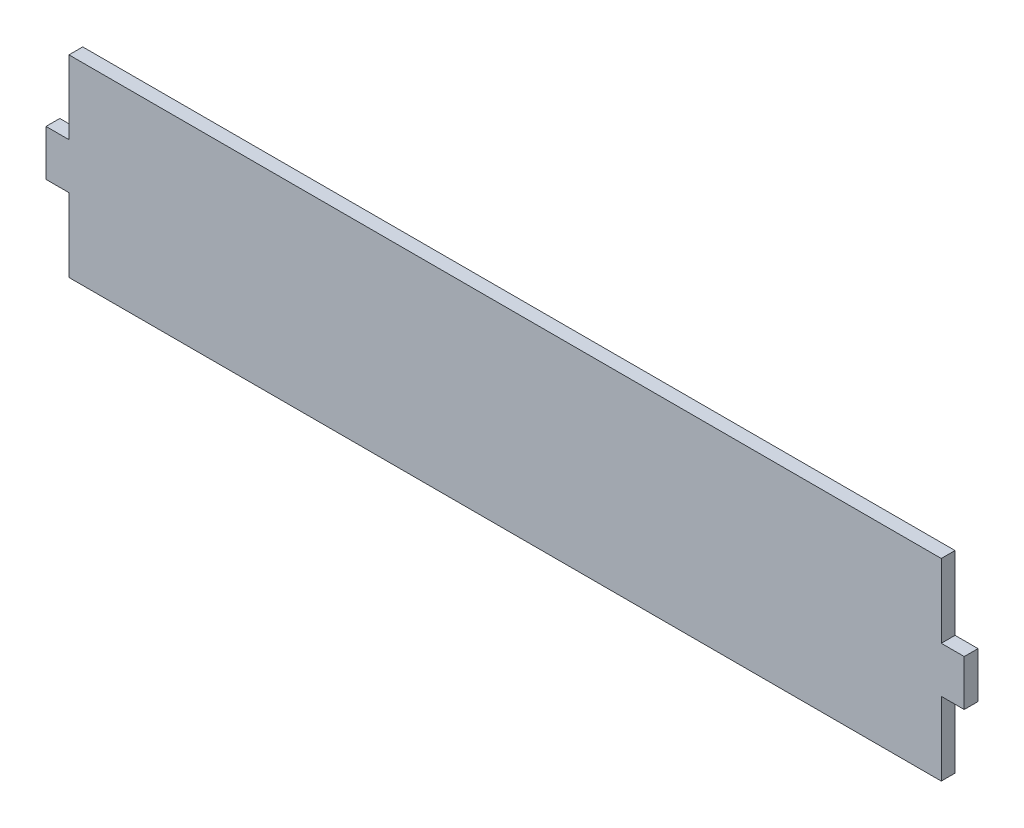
from build123d import *

# Parameters (mm, degrees)
EXTRUDE1_DEPTH = 3.81


with BuildPart() as part:
    # Sketch1 → Extrude1 (new body)
    with BuildSketch(Plane.XY):
        Polygon((-107.058637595, 12.7), (-107.058637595, 33.02), (134.241362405, 33.02), (134.241362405, 12.7), (140.591362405, 12.7), (140.591362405, 0), (134.241362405, 0), (134.241362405, -20.32), (-107.058637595, -20.32), (-107.058637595, 0), (-113.408637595, 0), (-113.408637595, 12.7), align=None)
    extrude(amount=EXTRUDE1_DEPTH)


solid = part.part
